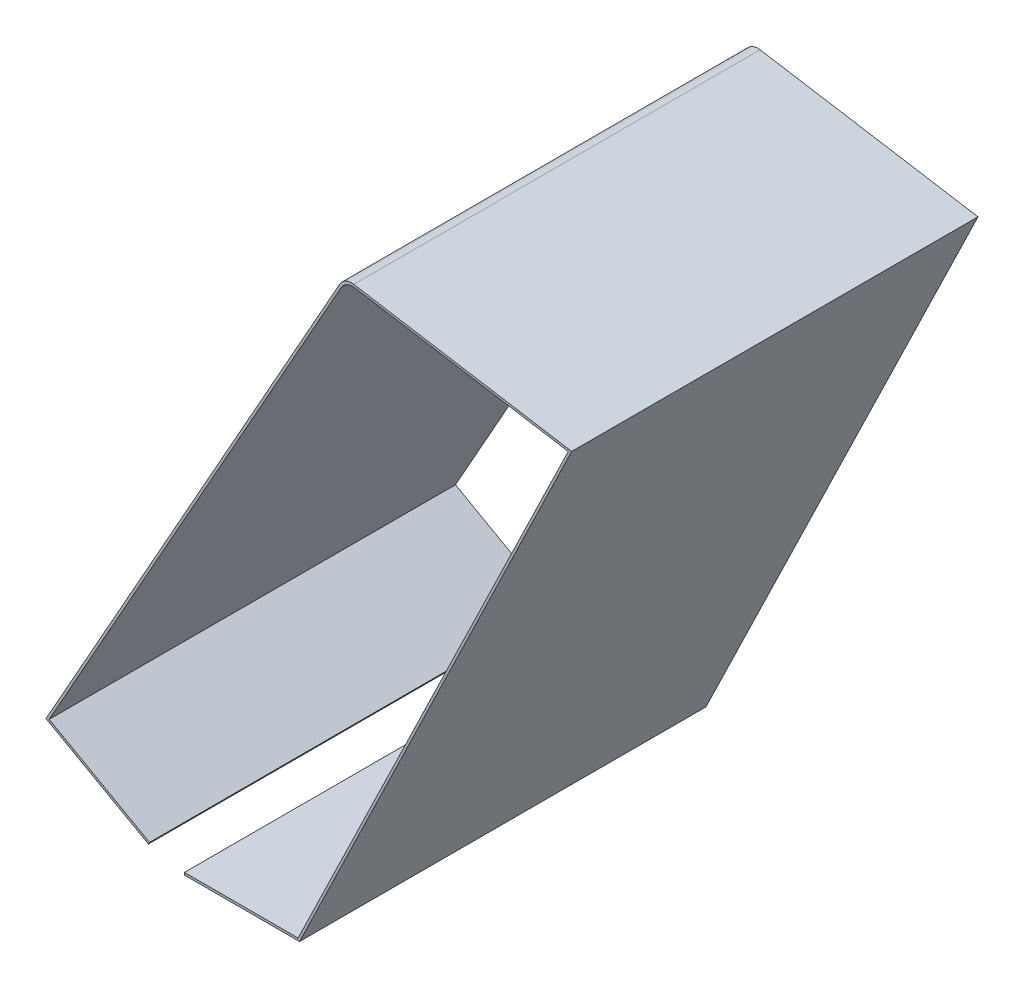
from build123d import *

# Parameters (mm, degrees)
BOSS_EXTRUDE1_DEPTH = 30


with BuildPart() as part:
    # Sketch1 → Boss-Extrude1 (new body)
    with BuildSketch(Plane.XY):
        with BuildLine():
            Line((-0.342841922, -0.610532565), (-22.033305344, -39.236888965))
            Line((-22.033305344, -39.236888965), (-14.473664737, -43.481972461))
            Line((-14.473664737, -43.481972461), (-14.390427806, -43.333744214))
            Line((-14.390427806, -43.333744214), (-21.801840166, -39.171897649))
            Line((-21.801840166, -39.171897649), (-0.252896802, -0.797560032))
            ThreePointArc((-0.252896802, -0.797560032), (0.185629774, -0.385989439), (0.78091691, -0.300379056))
            Line((0.78091691, -0.300379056), (16.523269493, -2.88285884))
            Line((16.523269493, -2.88285884), (-3.420439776, -43.963179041))
            Line((-3.420439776, -43.963179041), (-11.813996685, -43.963179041))
            Line((-11.813996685, -43.963179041), (-11.813996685, -44.133179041))
            Line((-11.813996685, -44.133179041), (-3.313996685, -44.133179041))
            Line((-3.313996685, -44.133179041), (16.775769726, -2.752008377))
            Line((16.775769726, -2.752008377), (0.690971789, -0.113351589))
            ThreePointArc((0.690971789, -0.113351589), (0.095684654, -0.198961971), (-0.342841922, -0.610532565))
        make_face()
    extrude(amount=BOSS_EXTRUDE1_DEPTH)


solid = part.part
